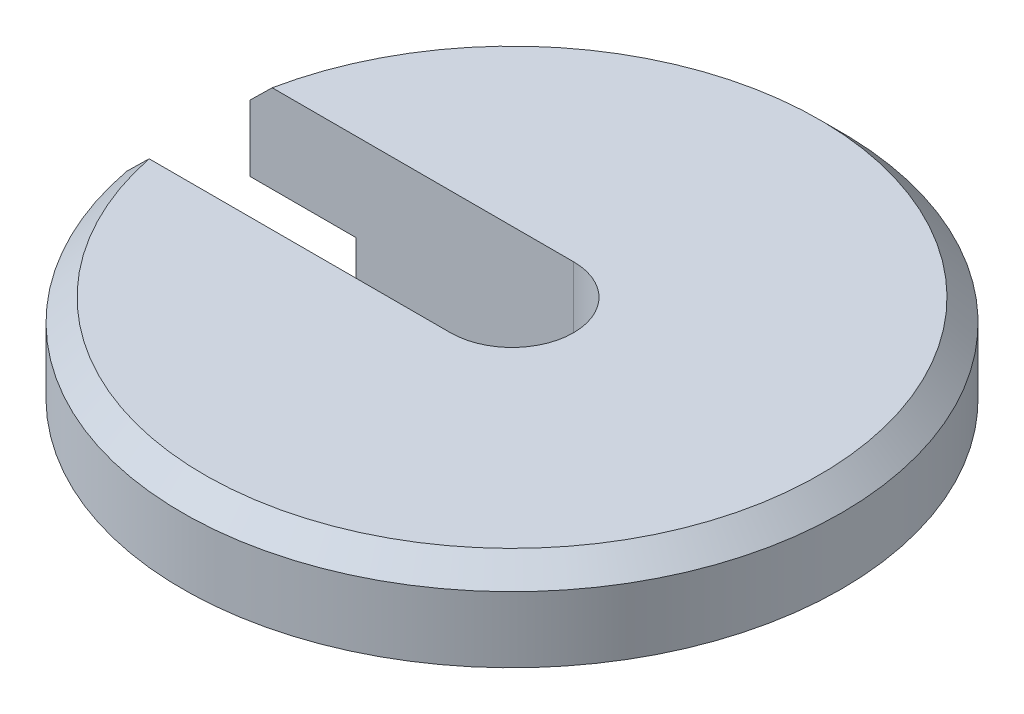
from build123d import *

# Parameters (mm, degrees)
CHANFREIN1_SIZE         = 5
ENL_V_MAT_EXTRU_1_REACH = 112.227


with BuildPart() as part:
    # Esquisse1 → R_volution1 (revolve)
    with BuildSketch(Plane.XY, mode=Mode.PRIVATE) as r_volution1_sk:
        Polygon((51.5, 395), (75, 395), (75, 415), (14, 415), (14, 385), (51.5, 385), align=None)
    revolve(r_volution1_sk.sketch.rotate(Axis((0, 427.07274653, 0), (0, -1, 0)), 180), axis=Axis((0, 427.07274653, 0), (0, -1, 0)))

    # Chanfrein1
    chanfrein1_edges = [part.edges().sort_by_distance(p)[0] for p in [
        (75, 415, 0),
    ]]
    chamfer(chanfrein1_edges, length=CHANFREIN1_SIZE)

    # Esquisse2 → Enl_v. mat.-Extru.1 (cut, up to next)
    with BuildSketch(Plane(origin=(0, 415, 0), x_dir=(1, 0, 0), z_dir=(0, 1, 0)), mode=Mode.PRIVATE) as enl_v_mat_extru_1_sk1:
        with BuildLine():
            Line((0, -14), (-73.681748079, -14))
            ThreePointArc((-73.681748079, -14), (-75, 0), (-73.681748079, 14))
            Line((-73.681748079, 14), (0, 14))
            ThreePointArc((0, 14), (14, 0), (0, -14))
        make_face()
    enl_v_mat_extru_1_tool1 = extrude(enl_v_mat_extru_1_sk1.sketch, amount=-ENL_V_MAT_EXTRU_1_REACH, mode=Mode.PRIVATE) & part.part
    add(enl_v_mat_extru_1_tool1.solids().sort_by_distance((-31.727122, 415, 0))[0], mode=Mode.SUBTRACT)


solid = part.part
